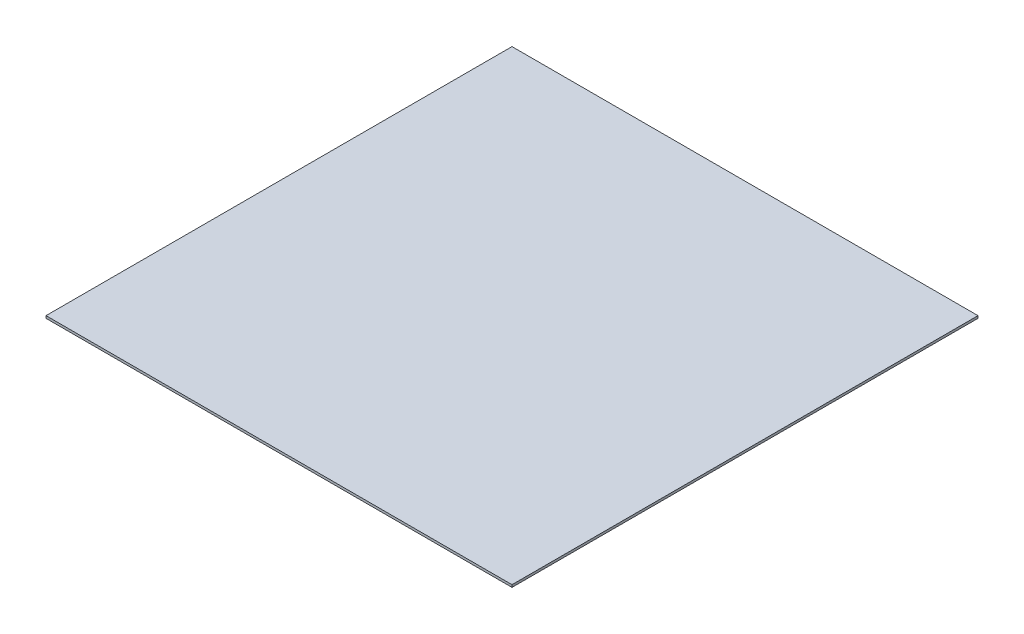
from build123d import *

# Parameters (mm, degrees)
SKETCH1_W           = 5000
SKETCH1_H           = 25.4
BOSS_EXTRUDE1_DEPTH = 2500


with BuildPart() as part:
    # Sketch1 → Boss-Extrude1 (new, symmetric)
    with BuildSketch(Plane(origin=(0, 0, 0), x_dir=(0, 0, -1), z_dir=(1, 0, 0))):
        Rectangle(SKETCH1_W, SKETCH1_H)
    extrude(amount=BOSS_EXTRUDE1_DEPTH, both=True)


solid = part.part
